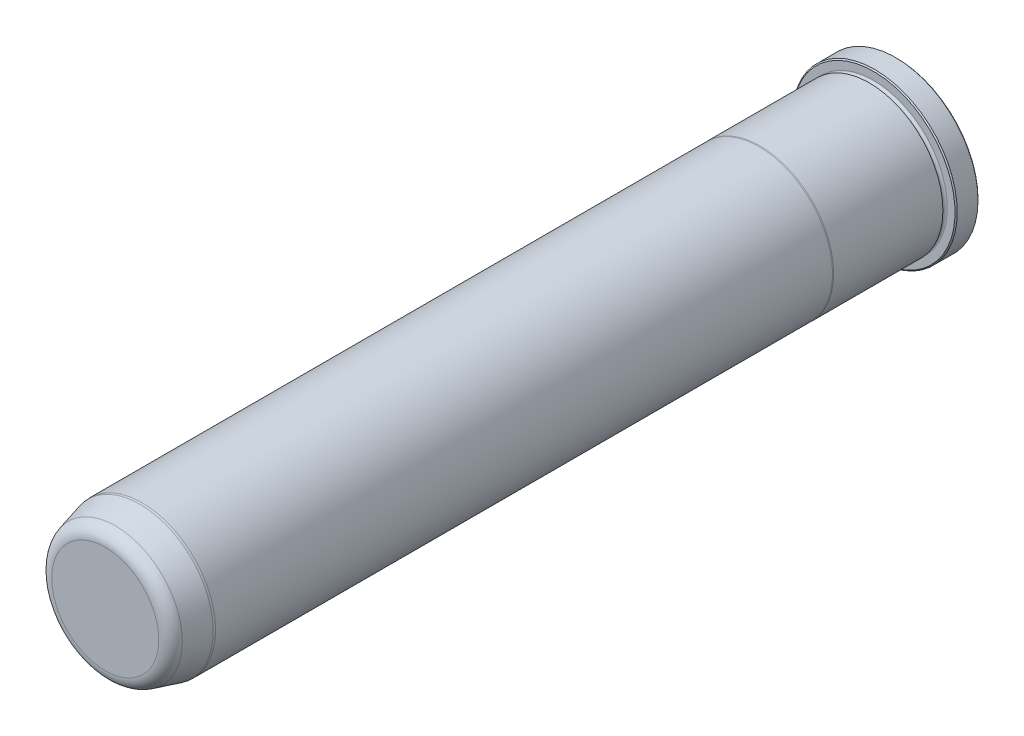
from build123d import *

# Parameters (mm, degrees)
FILLET6_R     = 4.7625
CHAMFER1_SIZE = 0.381


with BuildPart() as part:
    # Sketch1 → Revolve1 (revolve)
    with BuildSketch(Plane(origin=(0, 0, 0), x_dir=(0, 0, -1), z_dir=(1, 0, 0)), mode=Mode.PRIVATE) as revolve1_sk:
        with BuildLine():
            Line((0, 0), (0, 28.448))
            Line((0, 28.448), (-7.9248, 28.448))
            Line((-7.9248, 28.448), (-7.9248, 25.3873))
            ThreePointArc((-7.9248, 25.3873), (-8.6868, 24.6253), (-9.4488, 25.3873))
            Line((-9.4488, 25.3873), (-9.4488, 25.4127))
            Line((-9.4488, 25.4127), (-47.134763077, 25.4127))
            Line((-47.134763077, 25.4127), (-47.498, 25.3873))
            Line((-47.498, 25.3873), (-260.35, 25.3873))
            Line((-260.35, 25.3873), (-261.112, 25.320633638))
            Line((-261.112, 25.320633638), (-273.05, 22.121856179))
            Line((-273.05, 22.121856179), (-273.05, 0))
            Line((-273.05, 0), (0, 0))
        make_face()
    revolve(revolve1_sk.sketch.rotate(Axis((0, 0, 0), (0, 0, -1)), 90), axis=Axis((0, 0, 0), (0, 0, -1)))

    # Fillet6
    fillet6_edges = [part.edges().sort_by_distance(p)[0] for p in [
        (-22.121856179, 0, 273.05),
    ]]
    fillet(fillet6_edges, radius=FILLET6_R)

    # Chamfer1
    chamfer1_edges = [part.edges().sort_by_distance(p)[0] for p in [
        (-28.448, 0, 7.9248),
        (-28.448, 0, 0),
    ]]
    chamfer(chamfer1_edges, length=CHAMFER1_SIZE)


solid = part.part
